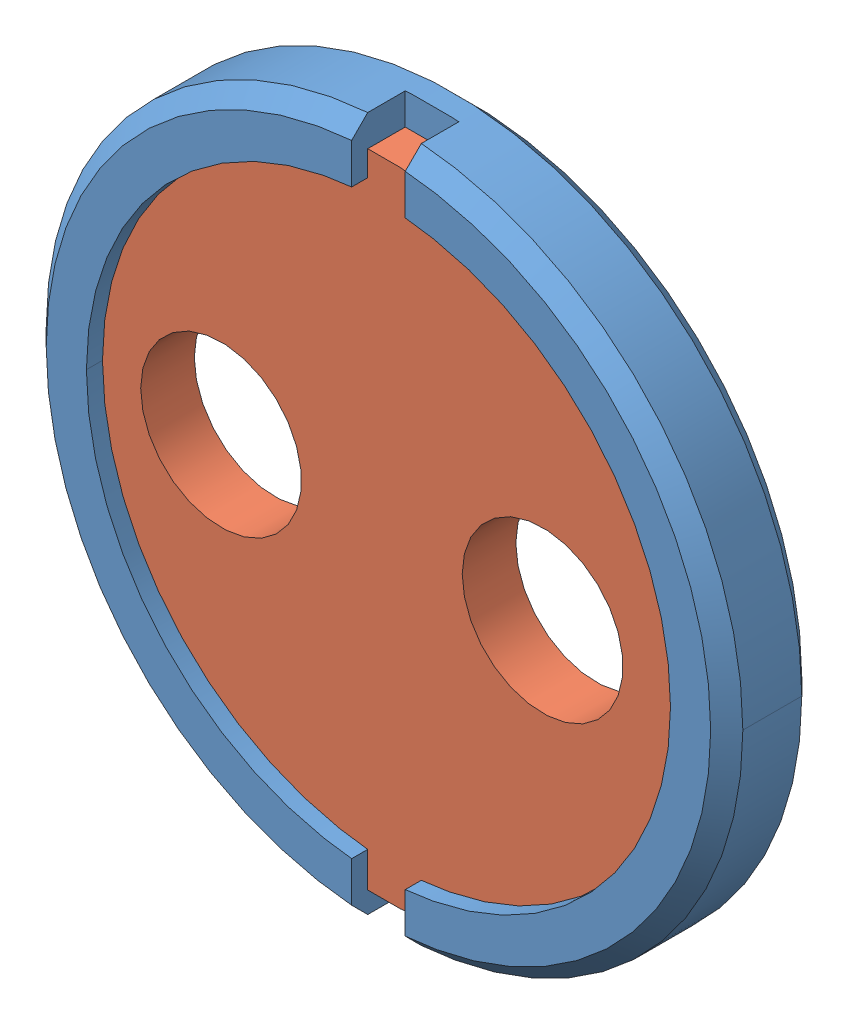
SolidWorks assembly 打孔.SLDASM, configuration 默认 (file format 15000). Lengths in mm.
Overall size (13 13 1.7).
2 component instances, 2 part files, 2 mates.
Components (placement in the parent):
- LO-SM05R_1-1: LO-SM05R_1.SLDPRT [默认] at (0.0242 -0.2738 13) size (13 13 1.7)
- 光阑-1: 光阑.SLDPRT [默认] at (-0.2127 -0.3676 14.4) x (-1 0 0) z (0 0 -1) size (12 12 1)
Mates (geometry in assembly coordinates):
- 平行1: parallel anti-aligned: cylinder of LO-SM05R_1-1 through (0.0242 -0.2738 14.7) axis (0 0 -1) radius 6.5; cylinder of 光阑-1 through (-0.2127 -0.3676 13.4) axis (0 0 1) radius 6
- 重合4: coincident: plane of 光阑-1 through (-0.2127 -0.3676 14.4) normal (0 0 1)
